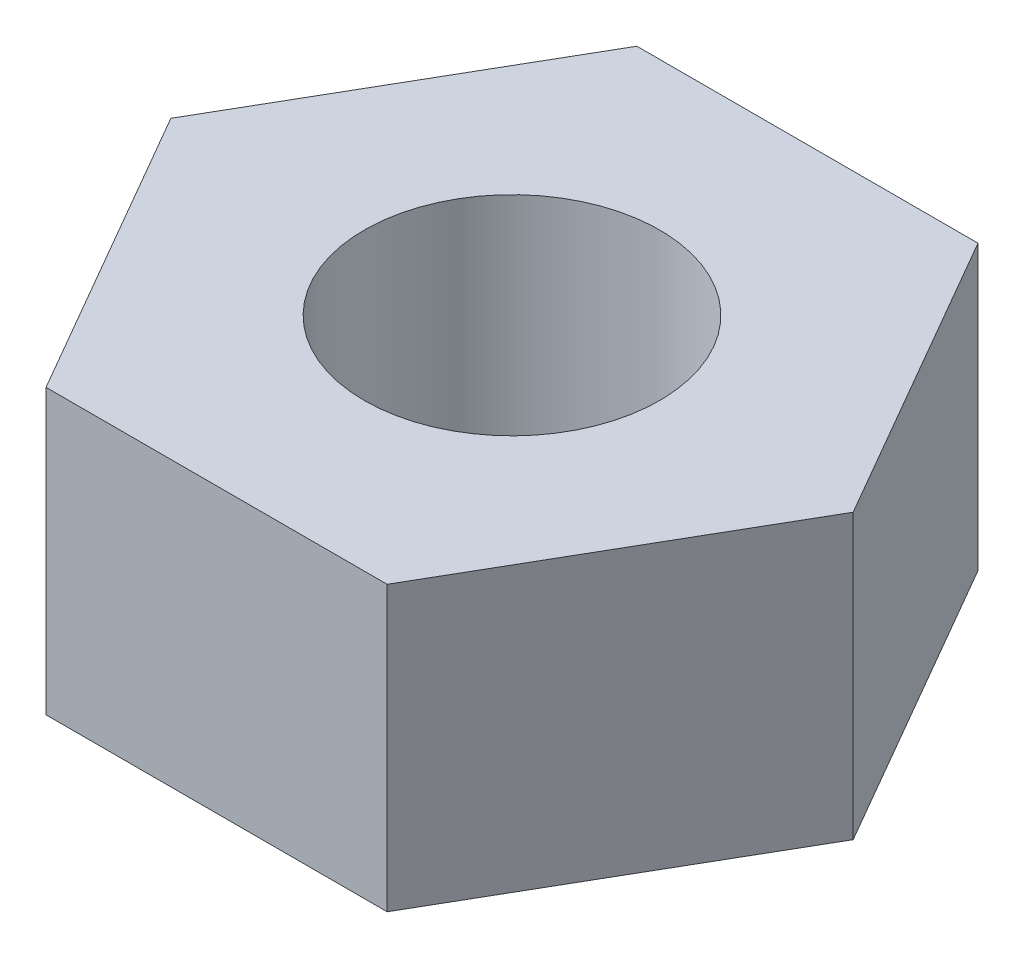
from build123d import *

# Parameters (mm, degrees)
EXTRUSION1_DEPTH      = 4.8
TROU_TARAUD_M6X1_01_D = 5


with BuildPart() as part:
    # Esquisse1 → Extrusion1 (new body)
    with BuildSketch(Plane(origin=(0, 0, 0), x_dir=(1, 0, 0), z_dir=(0, 1, 0))):
        Polygon((5.773502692, 0), (2.886751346, 5), (-2.886751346, 5), (-5.773502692, 0), (-2.886751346, -5), (2.886751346, -5), align=None)
    extrude(amount=EXTRUSION1_DEPTH)

    # Trou taraud_ M6x1.01 (through all)
    with Locations(Plane(origin=(0, 4.8, 0), x_dir=(-1, 0, 0), z_dir=(0, 1, 0))):
        with Locations((0, 0)):
            Hole(TROU_TARAUD_M6X1_01_D / 2)


solid = part.part
